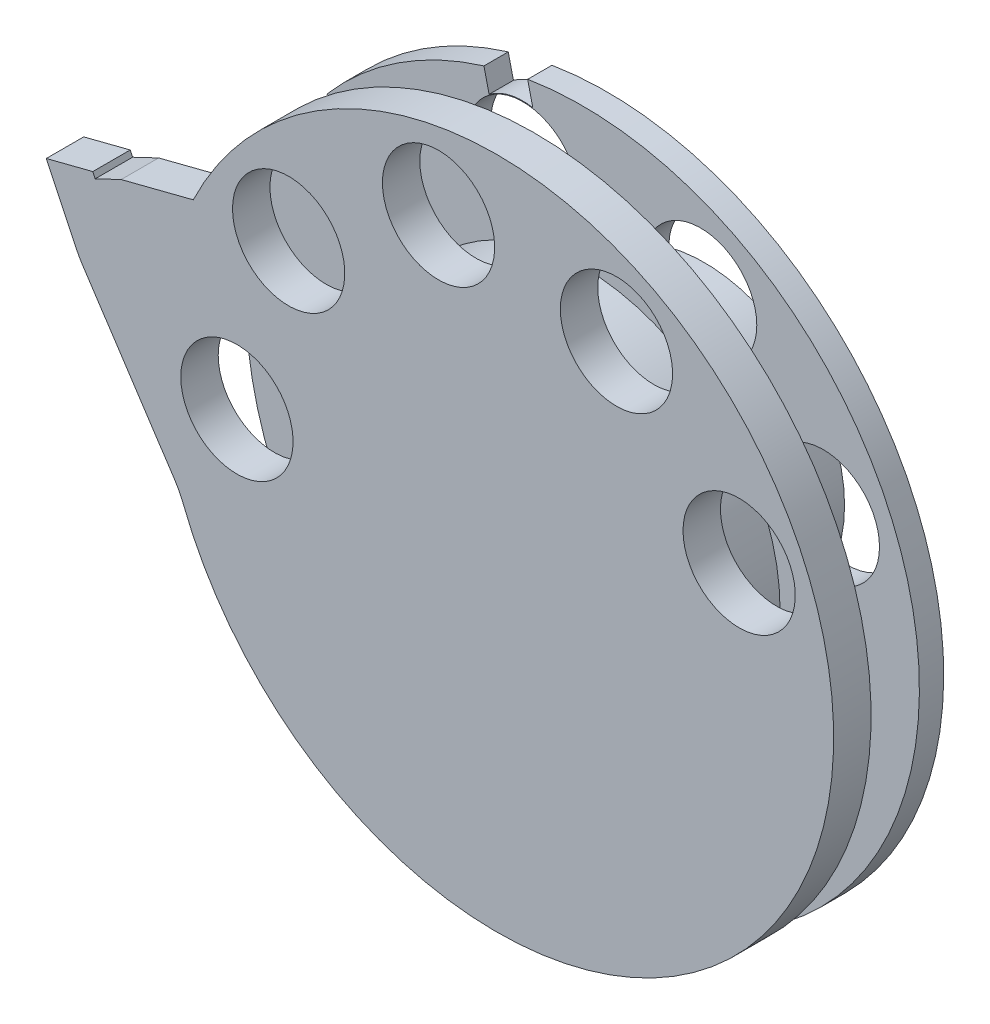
from build123d import *

# Parameters (mm, degrees)
SKETCH_1_R          = 9.25
SKETCH_1_R_2        = 3
EXTRUDE_1_DEPTH     = 1.3
SKETCH_2_R          = 10.55
SKETCH_2_R_2        = 9.25
EXTRUDE_2_DEPTH     = 2.5
EXTRUDE_3_DEPTH     = 2
SKETCH_4_R          = 3
CUT_EXTRUDE_1_DEPTH = 2.5
FILLET_1_R          = 1
SKETCH_6_R          = 3
CUT_EXTRUDE_3_DEPTH = 2.5
SKETCH_5_R          = 7.5
EXTRUDE_4_DEPTH     = 9


with BuildPart() as part:
    # Sketch 1 → Extrude 1 (new body)
    with BuildSketch(Plane(origin=(0, 0, 0), x_dir=(-1, 0, 0), z_dir=(0, 0, 1))):
        with BuildLine():
            ThreePointArc((6.519544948, -16.777828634), (17.865076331, 2.199783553), (2.254697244, 17.858228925))
            ThreePointArc((2.254697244, 17.858228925), (-17.865076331, -2.199783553), (6.519544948, -16.777828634))
        make_face()
        with Locations(Location((0, 0, 0), (0, 0, 180))):
            Circle(SKETCH_1_R, mode=Mode.SUBTRACT)
        with Locations(Location((-12.866075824, -5.519428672, 0), (0, 0, 180))):
            Circle(SKETCH_1_R_2, mode=Mode.SUBTRACT)
        with Locations(Location((13.977912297, 0.786109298, 0), (0, 0, 180))):
            Circle(SKETCH_1_R_2, mode=Mode.SUBTRACT)
        with Locations(Location((11.213003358, -8.382634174, 0), (0, 0, 180))):
            Circle(SKETCH_1_R_2, mode=Mode.SUBTRACT)
        with Locations(Location((3.201405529, -13.591477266, 0), (0, 0, 180))):
            Circle(SKETCH_1_R_2, mode=Mode.SUBTRACT)
        with Locations(Location((-6.308165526, -12.498281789, 0), (0, 0, 180))):
            Circle(SKETCH_1_R_2, mode=Mode.SUBTRACT)
    extrude(amount=EXTRUDE_1_DEPTH)

    # Sketch 2 → Extrude 2 (add)
    with BuildSketch(Plane.XY.offset(1.3)):
        Circle(SKETCH_2_R)
        Circle(SKETCH_2_R_2, mode=Mode.SUBTRACT)
    extrude(amount=EXTRUDE_2_DEPTH)

    # Sketch 3 → Extrude 3 (add)
    with BuildSketch(Plane.XY.offset(3.8)):
        with BuildLine():
            Line((-21.552245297, 6.094564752), (-20.163153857, 6.755573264))
            Line((-20.163153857, 6.755573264), (-16.31126404, 7.743408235))
            ThreePointArc((-16.31126404, 7.743408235), (12.538277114, 12.791379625), (7.974904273, -16.138771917))
            ThreePointArc((7.974904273, -16.138771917), (-6.533667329, -16.847060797), (-16.840978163, -6.611843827))
            ThreePointArc((-16.840978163, -6.611843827), (-17.05658706, -6.136456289), (-17.320583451, -5.686138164))
            Line((-17.320583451, -5.686138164), (-22.224885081, 1.759286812))
            ThreePointArc((-22.224885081, 1.759286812), (-22.404970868, 2.05441184), (-22.56423159, 2.361276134))
            Line((-22.56423159, 2.361276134), (-24.166710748, 5.728842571))
            Line((-24.166710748, 5.728842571), (-21.68149846, 6.366186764))
            Line((-21.68149846, 6.366186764), (-21.552245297, 6.094564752))
        make_face()
    extrude(amount=EXTRUDE_3_DEPTH)

    # Sketch 4 → Cut-Extrude 1 (cut)
    with BuildSketch(Plane(origin=(0, 0, 3.8), x_dir=(-1, 0, 0), z_dir=(0, 0, -1))):
        with Locations(Location((-12.866075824, 5.519428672, 0), (0, 0, 180))):
            Circle(SKETCH_4_R)
        with Locations(Location((-6.308165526, 12.498281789, 0), (0, 0, 180))):
            Circle(SKETCH_4_R)
        with Locations(Location((3.201405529, 13.591477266, 0), (0, 0, 180))):
            Circle(SKETCH_4_R)
        with Locations(Location((11.213003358, 8.382634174, 0), (0, 0, 180))):
            Circle(SKETCH_4_R)
        with Locations(Location((13.977912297, -0.786109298, 0), (0, 0, 180))):
            Circle(SKETCH_4_R)
    extrude(amount=-CUT_EXTRUDE_1_DEPTH, mode=Mode.SUBTRACT)

    # Fillet 1
    fillet_1_edges = [part.edges().sort_by_distance(p)[0] for p in [
        (-9.25, 0, 0),
        (-9.25, 0, 3.8),
    ]]
    fillet(fillet_1_edges, radius=FILLET_1_R)

    # Sketch 6 → Cut-Extrude 3 (cut)
    with BuildSketch(Plane(origin=(0, 0, 0), x_dir=(-1, 0, 0), z_dir=(0, 0, -1))):
        with BuildLine():
            Line((17.971601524, -1.010711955), (16.973179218, -0.95456129))
            ThreePointArc((16.973179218, -0.95456129), (16.875581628, -1.562969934), (16.655738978, -2.138604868))
            Line((16.655738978, -2.138604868), (17.864239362, -2.206570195))
            ThreePointArc((17.864239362, -2.206570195), (17.92789425, -1.609536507), (17.971601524, -1.010711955))
        make_face()
        with BuildLine():
            ThreePointArc((16.977912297, -0.786109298), (16.976728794, -0.870368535), (16.973179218, -0.95456129))
            Line((16.973179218, -0.95456129), (17.971601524, -1.010711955))
            ThreePointArc((17.971601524, -1.010711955), (17.99289898, -0.505555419), (18, 0))
            ThreePointArc((18, 0), (17.999750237, 0.094822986), (17.999000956, 0.189643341))
            Line((17.999000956, 0.189643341), (16.790500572, 0.257608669))
            ThreePointArc((16.790500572, 0.257608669), (16.930687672, -0.255904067), (16.977912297, -0.786109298))
        make_face()
        with BuildLine():
            Line((14.133705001, 9.067836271), (15.103157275, 9.792580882))
            ThreePointArc((15.103157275, 9.792580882), (14.416718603, 10.77767251), (13.666134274, 11.714810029))
            Line((13.666134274, 11.714810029), (12.696682, 10.990065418))
            ThreePointArc((12.696682, 10.990065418), (13.615789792, 10.178912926), (14.133705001, 9.067836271))
        make_face()
        with BuildLine():
            Line((4.998353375, 16.03133604), (5.275140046, 17.209674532))
            ThreePointArc((5.275140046, 17.209674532), (4.116092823, 17.523064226), (2.938731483, 17.758486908))
            Line((2.938731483, 17.758486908), (2.661944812, 16.580148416))
            ThreePointArc((2.661944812, 16.580148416), (3.887421, 16.549560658), (4.998353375, 16.03133604))
        make_face()
        with Locations(Location((-12.866075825, 5.519428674, 0), (0, 0, 180.000000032))):
            Circle(SKETCH_6_R)
    extrude(amount=-CUT_EXTRUDE_3_DEPTH, mode=Mode.SUBTRACT)

    # Sketch 5 → Extrude 4 (add)
    with BuildSketch(Plane(origin=(0, 0, 3.8), x_dir=(-1, 0, 0), z_dir=(0, 0, -1))):
        Circle(SKETCH_5_R)
    extrude(amount=EXTRUDE_4_DEPTH)


solid = part.part
